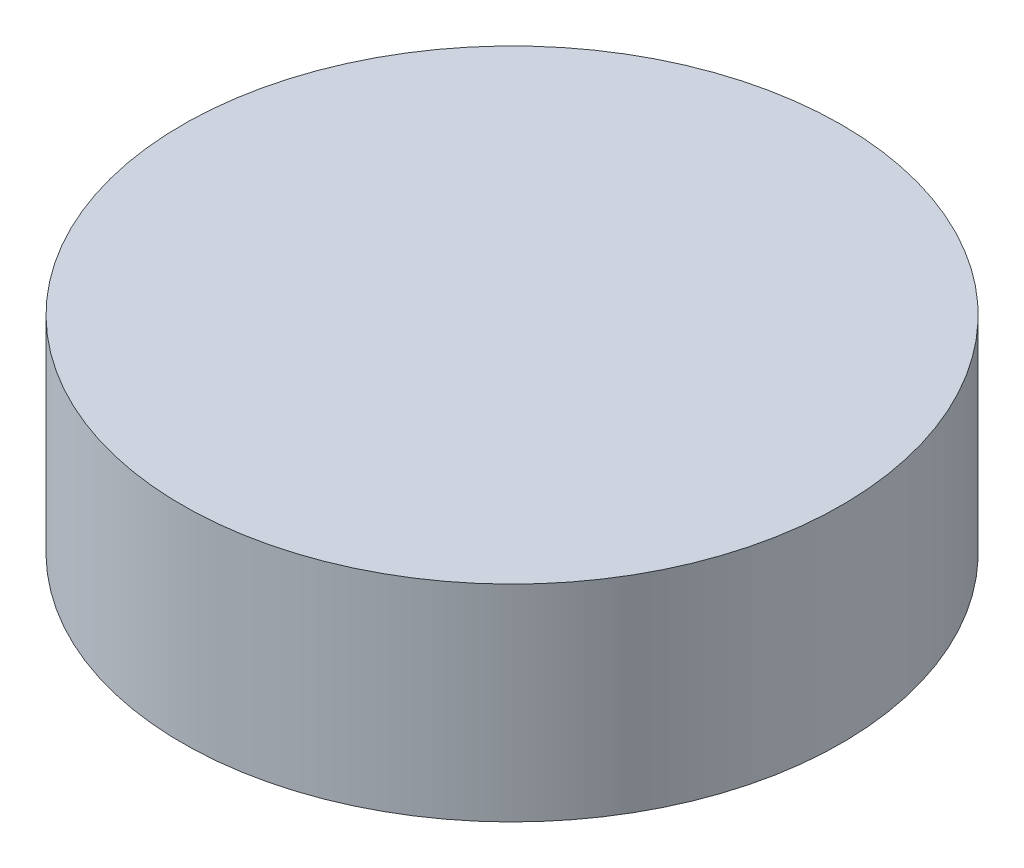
from build123d import *

# Parameters (mm, degrees)
ESQUISSE1_W = 8
ESQUISSE1_H = 5


with BuildPart() as part:
    # Esquisse1 → rebobinage (revolve)
    with BuildSketch(Plane.XY, mode=Mode.PRIVATE) as rebobinage_sk:
        with Locations((4, 2.5)):
            Rectangle(ESQUISSE1_W, ESQUISSE1_H)
    revolve(rebobinage_sk.sketch.rotate(Axis((0, 0, 0), (0, 1, 0)), 90), axis=Axis((0, 0, 0), (0, 1, 0)))


solid = part.part
